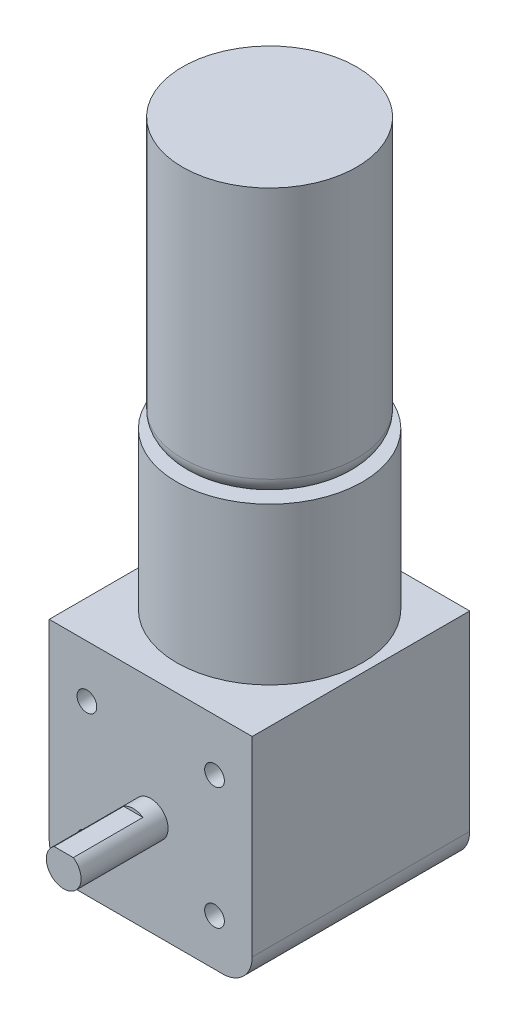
from build123d import *

# Parameters (mm, degrees)
SKETCH1_W                = 35
SKETCH1_H                = 37.5
BOSS_EXTRUDE1_DEPTH      = 38
SKETCH2_R                = 16
BOSS_EXTRUDE2_DEPTH      = 27
SKETCH3_R                = 15
BOSS_EXTRUDE3_DEPTH      = 46.5
SKETCH8_R                = 3
BOSS_EXTRUDE4_DEPTH      = 15
M3_CLEARANCE_HOLE1_D     = 3.4
M3_CLEARANCE_HOLE1_DEPTH = 12.7
M3_CLEARANCE_HOLE1_TIP   = 1.021463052
FILLET1_R                = 5.08
SKETCH12_W               = 5.08
SKETCH12_H               = 0.5
CUT_EXTRUDE1_DEPTH       = 12


with BuildPart() as part:
    # Sketch1 → Boss-Extrude1 (new body)
    with BuildSketch(Plane(origin=(0, 0, 0), x_dir=(1, 0, 0), z_dir=(0, 1, 0))):
        Rectangle(SKETCH1_W, SKETCH1_H)
    extrude(amount=-BOSS_EXTRUDE1_DEPTH)

    # Sketch2 → Boss-Extrude2 (add)
    with BuildSketch(Plane(origin=(0, 0, 0), x_dir=(1, 0, 0), z_dir=(0, 1, 0))):
        with Locations(Location((0, 1.75, 0), (0, 0, 270))):
            Circle(SKETCH2_R)
    extrude(amount=BOSS_EXTRUDE2_DEPTH)

    # Sketch3 → Boss-Extrude3 (add)
    with BuildSketch(Plane(origin=(0, 27, 0), x_dir=(1, 0, 0), z_dir=(0, 1, 0))):
        with Locations(Location((0, 1.75, 0), (0, 0, 90))):
            Circle(SKETCH3_R)
    extrude(amount=BOSS_EXTRUDE3_DEPTH)

    # Sketch7 → Cut-Revolve2 (revolve, cut)
    with BuildSketch(Plane(origin=(0, 0, 0), x_dir=(0, 0, -1), z_dir=(1, 0, 0)), mode=Mode.PRIVATE) as cut_revolve2_sk:
        with BuildLine():
            Line((13.75, 27), (16.75, 27))
            Line((16.75, 27), (16.75, 30))
            ThreePointArc((16.75, 30), (15.871320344, 27.878679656), (13.75, 27))
        make_face()
    revolve(cut_revolve2_sk.sketch.rotate(Axis((0, 73.5, -1.75), (0, -1, 0)), 180), axis=Axis((0, 73.5, -1.75), (0, -1, 0)), mode=Mode.SUBTRACT)

    # Sketch8 → Boss-Extrude4 (add)
    with BuildSketch(Plane.XY.offset(18.75)):
        with Locations((0, -21)):
            Circle(SKETCH8_R)
    extrude(amount=BOSS_EXTRUDE4_DEPTH)

    # M3 Clearance Hole1
    with Locations(Plane.XY.offset(18.75)):
        with Locations((-11, -9), (11, -9), (11, -30), (-11, -30)):
            Hole(M3_CLEARANCE_HOLE1_D / 2, depth=M3_CLEARANCE_HOLE1_DEPTH)
            with Locations((0, 0, -(M3_CLEARANCE_HOLE1_DEPTH + M3_CLEARANCE_HOLE1_TIP / 2))):  # 118° drill point
                Cone(0, M3_CLEARANCE_HOLE1_D / 2, M3_CLEARANCE_HOLE1_TIP, mode=Mode.SUBTRACT)

    # Fillet1
    fillet1_edges = [part.edges().sort_by_distance(p)[0] for p in [
        (-17.5, -38, 0),
        (17.5, -38, 0),
    ]]
    fillet(fillet1_edges, radius=FILLET1_R)

    # Sketch12 → Cut-Extrude1 (cut)
    with BuildSketch(Plane.XY.offset(33.75)):
        with Locations((0, -18.25)):
            Rectangle(SKETCH12_W, SKETCH12_H)
    extrude(amount=-CUT_EXTRUDE1_DEPTH, mode=Mode.SUBTRACT)


solid = part.part
